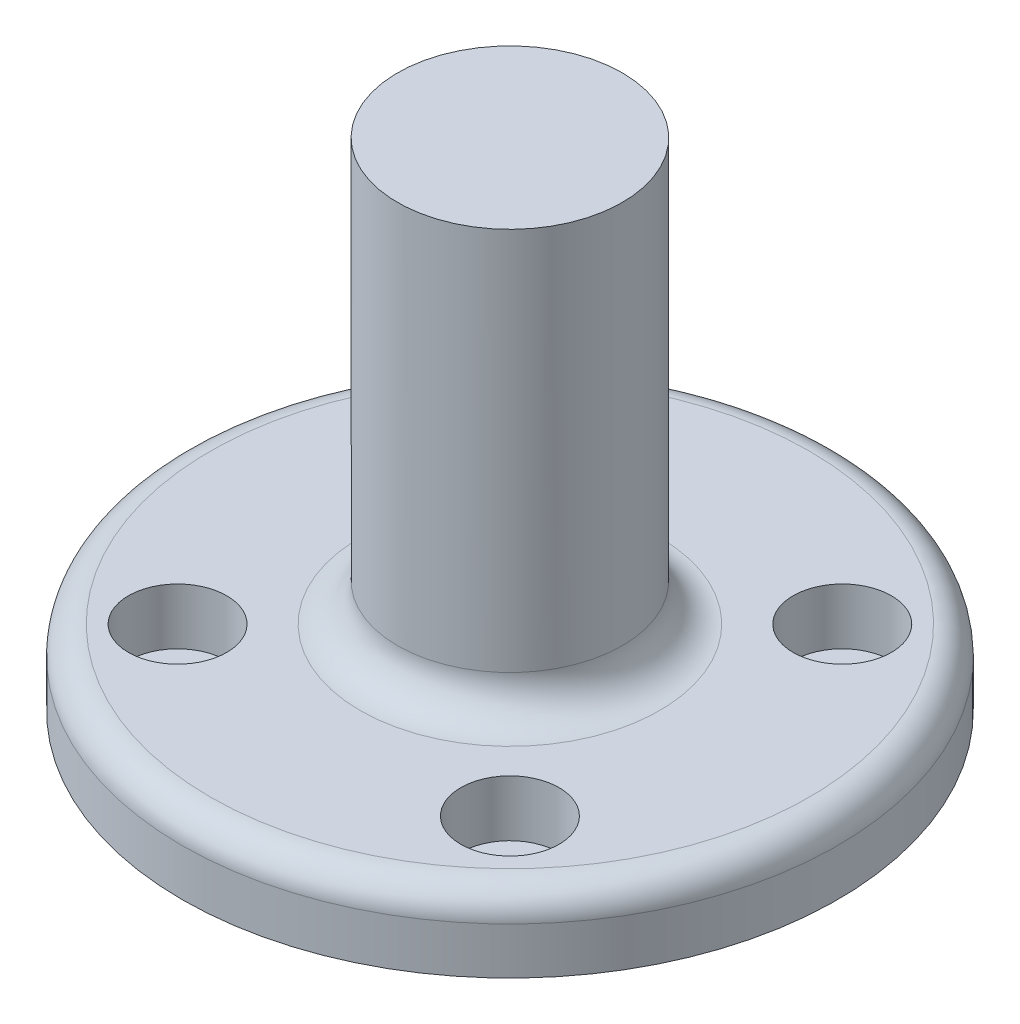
ISO-10303-21;
HEADER;
FILE_DESCRIPTION(('STEP AP214'),'2;1');
FILE_NAME('part.step','',(''),(''),'','','');
FILE_SCHEMA(('AUTOMOTIVE_DESIGN { 1 0 10303 214 1 1 1 1 }'));
ENDSEC;
DATA;
#1=APPLICATION_CONTEXT('core data for automotive mechanical design processes');
#2=APPLICATION_PROTOCOL_DEFINITION('international standard','automotive_design',2000,#1);
#3=PRODUCT_CONTEXT('',#1,'mechanical');
#4=PRODUCT('Part','Part','',(#3));
#5=PRODUCT_RELATED_PRODUCT_CATEGORY('part','',(#4));
#6=PRODUCT_DEFINITION_FORMATION('','',#4);
#7=PRODUCT_DEFINITION_CONTEXT('part definition',#1,'design');
#8=PRODUCT_DEFINITION('design','',#6,#7);
#9=PRODUCT_DEFINITION_SHAPE('','',#8);
#10=(LENGTH_UNIT() NAMED_UNIT(*) SI_UNIT(.MILLI.,.METRE.));
#11=(NAMED_UNIT(*) PLANE_ANGLE_UNIT() SI_UNIT($,.RADIAN.));
#12=(NAMED_UNIT(*) SI_UNIT($,.STERADIAN.) SOLID_ANGLE_UNIT());
#13=UNCERTAINTY_MEASURE_WITH_UNIT(LENGTH_MEASURE(1.E-05),#10,'distance_accuracy_value','');
#14=(GEOMETRIC_REPRESENTATION_CONTEXT(3) GLOBAL_UNCERTAINTY_ASSIGNED_CONTEXT((#13)) GLOBAL_UNIT_ASSIGNED_CONTEXT((#10,
#11,#12)) REPRESENTATION_CONTEXT('',''));
#15=CARTESIAN_POINT('',(0.,0.,0.));
#16=DIRECTION('',(0.,0.,1.));
#17=DIRECTION('',(1.,0.,0.));
#18=AXIS2_PLACEMENT_3D('',#15,#16,#17);
#19=CARTESIAN_POINT('',(0.,8.,0.));
#20=DIRECTION('',(0.,-1.,0.));
#21=DIRECTION('',(0.,0.,-1.));
#22=AXIS2_PLACEMENT_3D('',#19,#20,#21);
#23=CYLINDRICAL_SURFACE('',#22,35.);
#24=CARTESIAN_POINT('',(0.,5.,0.));
#25=DIRECTION('',(0.,1.,0.));
#26=DIRECTION('',(0.,0.,1.));
#27=AXIS2_PLACEMENT_3D('',#24,#25,#26);
#28=CIRCLE('',#27,35.);
#29=CARTESIAN_POINT('',(0.,5.,35.));
#30=VERTEX_POINT('',#29);
#31=EDGE_CURVE('E10',#30,#30,#28,.F.);
#32=ORIENTED_EDGE('',*,*,#31,.T.);
#33=EDGE_LOOP('',(#32));
#34=FACE_BOUND('',#33,.T.);
#35=CARTESIAN_POINT('',(0.,0.,0.));
#36=DIRECTION('',(0.,1.,0.));
#37=DIRECTION('',(0.,0.,1.));
#38=AXIS2_PLACEMENT_3D('',#35,#36,#37);
#39=CIRCLE('',#38,35.);
#40=CARTESIAN_POINT('',(0.,0.,35.));
#41=VERTEX_POINT('',#40);
#42=EDGE_CURVE('E50',#41,#41,#39,.T.);
#43=ORIENTED_EDGE('',*,*,#42,.T.);
#44=EDGE_LOOP('',(#43));
#45=FACE_BOUND('',#44,.T.);
#46=ADVANCED_FACE('F30',(#34,#45),#23,.T.);
#47=CARTESIAN_POINT('',(0.,8.,0.));
#48=DIRECTION('',(0.,1.,0.));
#49=DIRECTION('',(0.,0.,1.));
#50=AXIS2_PLACEMENT_3D('',#47,#48,#49);
#51=PLANE('',#50);
#52=CARTESIAN_POINT('',(0.,8.,0.));
#53=DIRECTION('',(0.,1.,0.));
#54=DIRECTION('',(0.,0.,1.));
#55=AXIS2_PLACEMENT_3D('',#52,#53,#54);
#56=CIRCLE('',#55,32.);
#57=CARTESIAN_POINT('',(0.,8.,32.));
#58=VERTEX_POINT('',#57);
#59=EDGE_CURVE('E37',#58,#58,#56,.T.);
#60=ORIENTED_EDGE('',*,*,#59,.T.);
#61=EDGE_LOOP('',(#60));
#62=FACE_BOUND('',#61,.T.);
#63=CARTESIAN_POINT('',(0.,8.,0.));
#64=DIRECTION('',(0.,1.,0.));
#65=DIRECTION('',(0.,0.,1.));
#66=AXIS2_PLACEMENT_3D('',#63,#64,#65);
#67=CIRCLE('',#66,16.);
#68=CARTESIAN_POINT('',(0.,8.,16.));
#69=VERTEX_POINT('',#68);
#70=EDGE_CURVE('E41',#69,#69,#67,.F.);
#71=ORIENTED_EDGE('',*,*,#70,.T.);
#72=EDGE_LOOP('',(#71));
#73=FACE_BOUND('',#72,.T.);
#74=CARTESIAN_POINT('',(-17.75,8.,17.75));
#75=DIRECTION('',(0.,1.,0.));
#76=DIRECTION('',(0.,0.,1.));
#77=AXIS2_PLACEMENT_3D('',#74,#75,#76);
#78=CIRCLE('',#77,5.25);
#79=CARTESIAN_POINT('',(-17.75,8.,23.));
#80=VERTEX_POINT('',#79);
#81=EDGE_CURVE('E72',#80,#80,#78,.T.);
#82=ORIENTED_EDGE('',*,*,#81,.F.);
#83=EDGE_LOOP('',(#82));
#84=FACE_BOUND('',#83,.T.);
#85=CARTESIAN_POINT('',(17.75,8.,17.75));
#86=DIRECTION('',(0.,1.,0.));
#87=DIRECTION('',(0.,0.,1.));
#88=AXIS2_PLACEMENT_3D('',#85,#86,#87);
#89=CIRCLE('',#88,5.25);
#90=CARTESIAN_POINT('',(17.75,8.,23.));
#91=VERTEX_POINT('',#90);
#92=EDGE_CURVE('E66',#91,#91,#89,.T.);
#93=ORIENTED_EDGE('',*,*,#92,.F.);
#94=EDGE_LOOP('',(#93));
#95=FACE_BOUND('',#94,.T.);
#96=CARTESIAN_POINT('',(17.75,8.,-17.75));
#97=DIRECTION('',(0.,1.,0.));
#98=DIRECTION('',(0.,0.,1.));
#99=AXIS2_PLACEMENT_3D('',#96,#97,#98);
#100=CIRCLE('',#99,5.25);
#101=CARTESIAN_POINT('',(17.75,8.,-12.5));
#102=VERTEX_POINT('',#101);
#103=EDGE_CURVE('E60',#102,#102,#100,.T.);
#104=ORIENTED_EDGE('',*,*,#103,.F.);
#105=EDGE_LOOP('',(#104));
#106=FACE_BOUND('',#105,.T.);
#107=CARTESIAN_POINT('',(-17.75,8.,-17.75));
#108=DIRECTION('',(0.,1.,0.));
#109=DIRECTION('',(0.,0.,1.));
#110=AXIS2_PLACEMENT_3D('',#107,#108,#109);
#111=CIRCLE('',#110,5.25);
#112=CARTESIAN_POINT('',(-17.75,8.,-12.5));
#113=VERTEX_POINT('',#112);
#114=EDGE_CURVE('E54',#113,#113,#111,.T.);
#115=ORIENTED_EDGE('',*,*,#114,.F.);
#116=EDGE_LOOP('',(#115));
#117=FACE_BOUND('',#116,.T.);
#118=ADVANCED_FACE('F120',(#62,#73,#84,#95,#106,#117),#51,.T.);
#119=CARTESIAN_POINT('',(0.,0.,0.));
#120=DIRECTION('',(0.,1.,0.));
#121=DIRECTION('',(0.,0.,1.));
#122=AXIS2_PLACEMENT_3D('',#119,#120,#121);
#123=PLANE('',#122);
#124=CARTESIAN_POINT('',(17.75,0.,17.75));
#125=DIRECTION('',(0.,1.,0.));
#126=DIRECTION('',(0.,0.,1.));
#127=AXIS2_PLACEMENT_3D('',#124,#125,#126);
#128=CIRCLE('',#127,3.25);
#129=CARTESIAN_POINT('',(17.75,0.,21.));
#130=VERTEX_POINT('',#129);
#131=EDGE_CURVE('E93',#130,#130,#128,.T.);
#132=ORIENTED_EDGE('',*,*,#131,.T.);
#133=EDGE_LOOP('',(#132));
#134=FACE_BOUND('',#133,.T.);
#135=CARTESIAN_POINT('',(-17.75,0.,17.75));
#136=DIRECTION('',(0.,1.,0.));
#137=DIRECTION('',(0.,0.,1.));
#138=AXIS2_PLACEMENT_3D('',#135,#136,#137);
#139=CIRCLE('',#138,3.25);
#140=CARTESIAN_POINT('',(-17.75,0.,21.));
#141=VERTEX_POINT('',#140);
#142=EDGE_CURVE('E87',#141,#141,#139,.T.);
#143=ORIENTED_EDGE('',*,*,#142,.T.);
#144=EDGE_LOOP('',(#143));
#145=FACE_BOUND('',#144,.T.);
#146=CARTESIAN_POINT('',(-17.75,0.,-17.75));
#147=DIRECTION('',(0.,1.,0.));
#148=DIRECTION('',(0.,0.,1.));
#149=AXIS2_PLACEMENT_3D('',#146,#147,#148);
#150=CIRCLE('',#149,3.25);
#151=CARTESIAN_POINT('',(-17.75,0.,-14.5));
#152=VERTEX_POINT('',#151);
#153=EDGE_CURVE('E81',#152,#152,#150,.T.);
#154=ORIENTED_EDGE('',*,*,#153,.T.);
#155=EDGE_LOOP('',(#154));
#156=FACE_BOUND('',#155,.T.);
#157=CARTESIAN_POINT('',(17.75,0.,-17.75));
#158=DIRECTION('',(0.,1.,0.));
#159=DIRECTION('',(0.,0.,1.));
#160=AXIS2_PLACEMENT_3D('',#157,#158,#159);
#161=CIRCLE('',#160,3.25);
#162=CARTESIAN_POINT('',(17.75,0.,-14.5));
#163=VERTEX_POINT('',#162);
#164=EDGE_CURVE('E75',#163,#163,#161,.T.);
#165=ORIENTED_EDGE('',*,*,#164,.T.);
#166=EDGE_LOOP('',(#165));
#167=FACE_BOUND('',#166,.T.);
#168=ORIENTED_EDGE('',*,*,#42,.F.);
#169=EDGE_LOOP('',(#168));
#170=FACE_BOUND('',#169,.T.);
#171=ADVANCED_FACE('F125',(#134,#145,#156,#167,#170),#123,.F.);
#172=CARTESIAN_POINT('',(-17.75,2.,-17.75));
#173=DIRECTION('',(0.,1.,0.));
#174=DIRECTION('',(0.,0.,1.));
#175=AXIS2_PLACEMENT_3D('',#172,#173,#174);
#176=CYLINDRICAL_SURFACE('',#175,5.25);
#177=CARTESIAN_POINT('',(-17.75,2.,-17.75));
#178=DIRECTION('',(0.,1.,0.));
#179=DIRECTION('',(0.,0.,1.));
#180=AXIS2_PLACEMENT_3D('',#177,#178,#179);
#181=CIRCLE('',#180,5.25);
#182=CARTESIAN_POINT('',(-17.75,2.,-12.5));
#183=VERTEX_POINT('',#182);
#184=EDGE_CURVE('E53',#183,#183,#181,.T.);
#185=ORIENTED_EDGE('',*,*,#184,.F.);
#186=EDGE_LOOP('',(#185));
#187=FACE_BOUND('',#186,.T.);
#188=ORIENTED_EDGE('',*,*,#114,.T.);
#189=EDGE_LOOP('',(#188));
#190=FACE_BOUND('',#189,.T.);
#191=ADVANCED_FACE('F130',(#187,#190),#176,.F.);
#192=CARTESIAN_POINT('',(-17.75,2.,-17.75));
#193=DIRECTION('',(0.,1.,0.));
#194=DIRECTION('',(0.,0.,1.));
#195=AXIS2_PLACEMENT_3D('',#192,#193,#194);
#196=PLANE('',#195);
#197=CARTESIAN_POINT('',(-17.75,2.,-17.75));
#198=DIRECTION('',(0.,1.,0.));
#199=DIRECTION('',(0.,0.,1.));
#200=AXIS2_PLACEMENT_3D('',#197,#198,#199);
#201=CIRCLE('',#200,3.25);
#202=CARTESIAN_POINT('',(-17.75,2.,-14.5));
#203=VERTEX_POINT('',#202);
#204=EDGE_CURVE('E84',#203,#203,#201,.T.);
#205=ORIENTED_EDGE('',*,*,#204,.F.);
#206=EDGE_LOOP('',(#205));
#207=FACE_BOUND('',#206,.T.);
#208=ORIENTED_EDGE('',*,*,#184,.T.);
#209=EDGE_LOOP('',(#208));
#210=FACE_BOUND('',#209,.T.);
#211=ADVANCED_FACE('F135',(#207,#210),#196,.T.);
#212=CARTESIAN_POINT('',(17.75,2.,-17.75));
#213=DIRECTION('',(0.,1.,0.));
#214=DIRECTION('',(0.,0.,1.));
#215=AXIS2_PLACEMENT_3D('',#212,#213,#214);
#216=CYLINDRICAL_SURFACE('',#215,5.25);
#217=CARTESIAN_POINT('',(17.75,2.,-17.75));
#218=DIRECTION('',(0.,1.,0.));
#219=DIRECTION('',(0.,0.,1.));
#220=AXIS2_PLACEMENT_3D('',#217,#218,#219);
#221=CIRCLE('',#220,5.25);
#222=CARTESIAN_POINT('',(17.75,2.,-12.5));
#223=VERTEX_POINT('',#222);
#224=EDGE_CURVE('E57',#223,#223,#221,.T.);
#225=ORIENTED_EDGE('',*,*,#224,.F.);
#226=EDGE_LOOP('',(#225));
#227=FACE_BOUND('',#226,.T.);
#228=ORIENTED_EDGE('',*,*,#103,.T.);
#229=EDGE_LOOP('',(#228));
#230=FACE_BOUND('',#229,.T.);
#231=ADVANCED_FACE('F139',(#227,#230),#216,.F.);
#232=CARTESIAN_POINT('',(17.75,2.,-17.75));
#233=DIRECTION('',(0.,1.,0.));
#234=DIRECTION('',(0.,0.,1.));
#235=AXIS2_PLACEMENT_3D('',#232,#233,#234);
#236=PLANE('',#235);
#237=CARTESIAN_POINT('',(17.75,2.,-17.75));
#238=DIRECTION('',(0.,1.,0.));
#239=DIRECTION('',(0.,0.,1.));
#240=AXIS2_PLACEMENT_3D('',#237,#238,#239);
#241=CIRCLE('',#240,3.25);
#242=CARTESIAN_POINT('',(17.75,2.,-14.5));
#243=VERTEX_POINT('',#242);
#244=EDGE_CURVE('E78',#243,#243,#241,.T.);
#245=ORIENTED_EDGE('',*,*,#244,.F.);
#246=EDGE_LOOP('',(#245));
#247=FACE_BOUND('',#246,.T.);
#248=ORIENTED_EDGE('',*,*,#224,.T.);
#249=EDGE_LOOP('',(#248));
#250=FACE_BOUND('',#249,.T.);
#251=ADVANCED_FACE('F143',(#247,#250),#236,.T.);
#252=CARTESIAN_POINT('',(17.75,2.,17.75));
#253=DIRECTION('',(0.,1.,0.));
#254=DIRECTION('',(0.,0.,1.));
#255=AXIS2_PLACEMENT_3D('',#252,#253,#254);
#256=CYLINDRICAL_SURFACE('',#255,5.25);
#257=CARTESIAN_POINT('',(17.75,2.,17.75));
#258=DIRECTION('',(0.,1.,0.));
#259=DIRECTION('',(0.,0.,1.));
#260=AXIS2_PLACEMENT_3D('',#257,#258,#259);
#261=CIRCLE('',#260,5.25);
#262=CARTESIAN_POINT('',(17.75,2.,23.));
#263=VERTEX_POINT('',#262);
#264=EDGE_CURVE('E63',#263,#263,#261,.T.);
#265=ORIENTED_EDGE('',*,*,#264,.F.);
#266=EDGE_LOOP('',(#265));
#267=FACE_BOUND('',#266,.T.);
#268=ORIENTED_EDGE('',*,*,#92,.T.);
#269=EDGE_LOOP('',(#268));
#270=FACE_BOUND('',#269,.T.);
#271=ADVANCED_FACE('F147',(#267,#270),#256,.F.);
#272=CARTESIAN_POINT('',(17.75,2.,17.75));
#273=DIRECTION('',(0.,1.,0.));
#274=DIRECTION('',(0.,0.,1.));
#275=AXIS2_PLACEMENT_3D('',#272,#273,#274);
#276=PLANE('',#275);
#277=CARTESIAN_POINT('',(17.75,2.,17.75));
#278=DIRECTION('',(0.,1.,0.));
#279=DIRECTION('',(0.,0.,1.));
#280=AXIS2_PLACEMENT_3D('',#277,#278,#279);
#281=CIRCLE('',#280,3.25);
#282=CARTESIAN_POINT('',(17.75,2.,21.));
#283=VERTEX_POINT('',#282);
#284=EDGE_CURVE('E96',#283,#283,#281,.T.);
#285=ORIENTED_EDGE('',*,*,#284,.F.);
#286=EDGE_LOOP('',(#285));
#287=FACE_BOUND('',#286,.T.);
#288=ORIENTED_EDGE('',*,*,#264,.T.);
#289=EDGE_LOOP('',(#288));
#290=FACE_BOUND('',#289,.T.);
#291=ADVANCED_FACE('F151',(#287,#290),#276,.T.);
#292=CARTESIAN_POINT('',(-17.75,2.,17.75));
#293=DIRECTION('',(0.,1.,0.));
#294=DIRECTION('',(0.,0.,1.));
#295=AXIS2_PLACEMENT_3D('',#292,#293,#294);
#296=CYLINDRICAL_SURFACE('',#295,5.25);
#297=CARTESIAN_POINT('',(-17.75,2.,17.75));
#298=DIRECTION('',(0.,1.,0.));
#299=DIRECTION('',(0.,0.,1.));
#300=AXIS2_PLACEMENT_3D('',#297,#298,#299);
#301=CIRCLE('',#300,5.25);
#302=CARTESIAN_POINT('',(-17.75,2.,23.));
#303=VERTEX_POINT('',#302);
#304=EDGE_CURVE('E69',#303,#303,#301,.T.);
#305=ORIENTED_EDGE('',*,*,#304,.F.);
#306=EDGE_LOOP('',(#305));
#307=FACE_BOUND('',#306,.T.);
#308=ORIENTED_EDGE('',*,*,#81,.T.);
#309=EDGE_LOOP('',(#308));
#310=FACE_BOUND('',#309,.T.);
#311=ADVANCED_FACE('F155',(#307,#310),#296,.F.);
#312=CARTESIAN_POINT('',(-17.75,2.,17.75));
#313=DIRECTION('',(0.,1.,0.));
#314=DIRECTION('',(0.,0.,1.));
#315=AXIS2_PLACEMENT_3D('',#312,#313,#314);
#316=PLANE('',#315);
#317=CARTESIAN_POINT('',(-17.75,2.,17.75));
#318=DIRECTION('',(0.,1.,0.));
#319=DIRECTION('',(0.,0.,1.));
#320=AXIS2_PLACEMENT_3D('',#317,#318,#319);
#321=CIRCLE('',#320,3.25);
#322=CARTESIAN_POINT('',(-17.75,2.,21.));
#323=VERTEX_POINT('',#322);
#324=EDGE_CURVE('E90',#323,#323,#321,.T.);
#325=ORIENTED_EDGE('',*,*,#324,.F.);
#326=EDGE_LOOP('',(#325));
#327=FACE_BOUND('',#326,.T.);
#328=ORIENTED_EDGE('',*,*,#304,.T.);
#329=EDGE_LOOP('',(#328));
#330=FACE_BOUND('',#329,.T.);
#331=ADVANCED_FACE('F159',(#327,#330),#316,.T.);
#332=CARTESIAN_POINT('',(17.75,0.,-17.75));
#333=DIRECTION('',(0.,1.,0.));
#334=DIRECTION('',(0.,0.,1.));
#335=AXIS2_PLACEMENT_3D('',#332,#333,#334);
#336=CYLINDRICAL_SURFACE('',#335,3.25);
#337=ORIENTED_EDGE('',*,*,#164,.F.);
#338=EDGE_LOOP('',(#337));
#339=FACE_BOUND('',#338,.T.);
#340=ORIENTED_EDGE('',*,*,#244,.T.);
#341=EDGE_LOOP('',(#340));
#342=FACE_BOUND('',#341,.T.);
#343=ADVANCED_FACE('F163',(#339,#342),#336,.F.);
#344=CARTESIAN_POINT('',(-17.75,0.,-17.75));
#345=DIRECTION('',(0.,1.,0.));
#346=DIRECTION('',(0.,0.,1.));
#347=AXIS2_PLACEMENT_3D('',#344,#345,#346);
#348=CYLINDRICAL_SURFACE('',#347,3.25);
#349=ORIENTED_EDGE('',*,*,#153,.F.);
#350=EDGE_LOOP('',(#349));
#351=FACE_BOUND('',#350,.T.);
#352=ORIENTED_EDGE('',*,*,#204,.T.);
#353=EDGE_LOOP('',(#352));
#354=FACE_BOUND('',#353,.T.);
#355=ADVANCED_FACE('F167',(#351,#354),#348,.F.);
#356=CARTESIAN_POINT('',(-17.75,0.,17.75));
#357=DIRECTION('',(0.,1.,0.));
#358=DIRECTION('',(0.,0.,1.));
#359=AXIS2_PLACEMENT_3D('',#356,#357,#358);
#360=CYLINDRICAL_SURFACE('',#359,3.25);
#361=ORIENTED_EDGE('',*,*,#142,.F.);
#362=EDGE_LOOP('',(#361));
#363=FACE_BOUND('',#362,.T.);
#364=ORIENTED_EDGE('',*,*,#324,.T.);
#365=EDGE_LOOP('',(#364));
#366=FACE_BOUND('',#365,.T.);
#367=ADVANCED_FACE('F171',(#363,#366),#360,.F.);
#368=CARTESIAN_POINT('',(17.75,0.,17.75));
#369=DIRECTION('',(0.,1.,0.));
#370=DIRECTION('',(0.,0.,1.));
#371=AXIS2_PLACEMENT_3D('',#368,#369,#370);
#372=CYLINDRICAL_SURFACE('',#371,3.25);
#373=ORIENTED_EDGE('',*,*,#131,.F.);
#374=EDGE_LOOP('',(#373));
#375=FACE_BOUND('',#374,.T.);
#376=ORIENTED_EDGE('',*,*,#284,.T.);
#377=EDGE_LOOP('',(#376));
#378=FACE_BOUND('',#377,.T.);
#379=ADVANCED_FACE('F116',(#375,#378),#372,.F.);
#380=CARTESIAN_POINT('',(0.,43.,0.));
#381=DIRECTION('',(0.,-1.,0.));
#382=DIRECTION('',(0.,0.,-1.));
#383=AXIS2_PLACEMENT_3D('',#380,#381,#382);
#384=CYLINDRICAL_SURFACE('',#383,12.);
#385=CARTESIAN_POINT('',(0.,12.,0.));
#386=DIRECTION('',(0.,1.,0.));
#387=DIRECTION('',(0.,0.,1.));
#388=AXIS2_PLACEMENT_3D('',#385,#386,#387);
#389=CIRCLE('',#388,12.);
#390=CARTESIAN_POINT('',(0.,12.,12.));
#391=VERTEX_POINT('',#390);
#392=EDGE_CURVE('E45',#391,#391,#389,.T.);
#393=ORIENTED_EDGE('',*,*,#392,.T.);
#394=EDGE_LOOP('',(#393));
#395=FACE_BOUND('',#394,.T.);
#396=CARTESIAN_POINT('',(0.,53.,0.));
#397=DIRECTION('',(0.,-1.,0.));
#398=DIRECTION('',(0.,0.,-1.));
#399=AXIS2_PLACEMENT_3D('',#396,#397,#398);
#400=CIRCLE('',#399,12.);
#401=CARTESIAN_POINT('',(0.,53.,-12.));
#402=VERTEX_POINT('',#401);
#403=EDGE_CURVE('E99',#402,#402,#400,.T.);
#404=ORIENTED_EDGE('',*,*,#403,.T.);
#405=EDGE_LOOP('',(#404));
#406=FACE_BOUND('',#405,.T.);
#407=ADVANCED_FACE('F105',(#395,#406),#384,.T.);
#408=CARTESIAN_POINT('',(12.,53.,0.));
#409=DIRECTION('',(0.,1.,0.));
#410=DIRECTION('',(0.,0.,1.));
#411=AXIS2_PLACEMENT_3D('',#408,#409,#410);
#412=PLANE('',#411);
#413=ORIENTED_EDGE('',*,*,#403,.F.);
#414=EDGE_LOOP('',(#413));
#415=FACE_BOUND('',#414,.T.);
#416=ADVANCED_FACE('F107',(#415),#412,.T.);
#417=CARTESIAN_POINT('',(0.,12.,0.));
#418=DIRECTION('',(0.,1.,0.));
#419=DIRECTION('',(0.,0.,1.));
#420=AXIS2_PLACEMENT_3D('',#417,#418,#419);
#421=TOROIDAL_SURFACE('',#420,16.,4.);
#422=ORIENTED_EDGE('',*,*,#70,.F.);
#423=EDGE_LOOP('',(#422));
#424=FACE_BOUND('',#423,.T.);
#425=ORIENTED_EDGE('',*,*,#392,.F.);
#426=EDGE_LOOP('',(#425));
#427=FACE_BOUND('',#426,.T.);
#428=ADVANCED_FACE('F109',(#424,#427),#421,.F.);
#429=CARTESIAN_POINT('',(0.,5.,0.));
#430=DIRECTION('',(0.,1.,0.));
#431=DIRECTION('',(0.,0.,1.));
#432=AXIS2_PLACEMENT_3D('',#429,#430,#431);
#433=TOROIDAL_SURFACE('',#432,32.,3.);
#434=ORIENTED_EDGE('',*,*,#31,.F.);
#435=EDGE_LOOP('',(#434));
#436=FACE_BOUND('',#435,.T.);
#437=ORIENTED_EDGE('',*,*,#59,.F.);
#438=EDGE_LOOP('',(#437));
#439=FACE_BOUND('',#438,.T.);
#440=ADVANCED_FACE('F32',(#436,#439),#433,.T.);
#441=CLOSED_SHELL('',(#46,#118,#171,#191,#211,#231,#251,#271,#291,#311,#331,#343,#355,#367,#379,
#407,#416,#428,#440));
#442=MANIFOLD_SOLID_BREP('B2',#441);
#443=ADVANCED_BREP_SHAPE_REPRESENTATION('',(#18,#442),#14);
#444=SHAPE_DEFINITION_REPRESENTATION(#9,#443);
ENDSEC;
END-ISO-10303-21;
